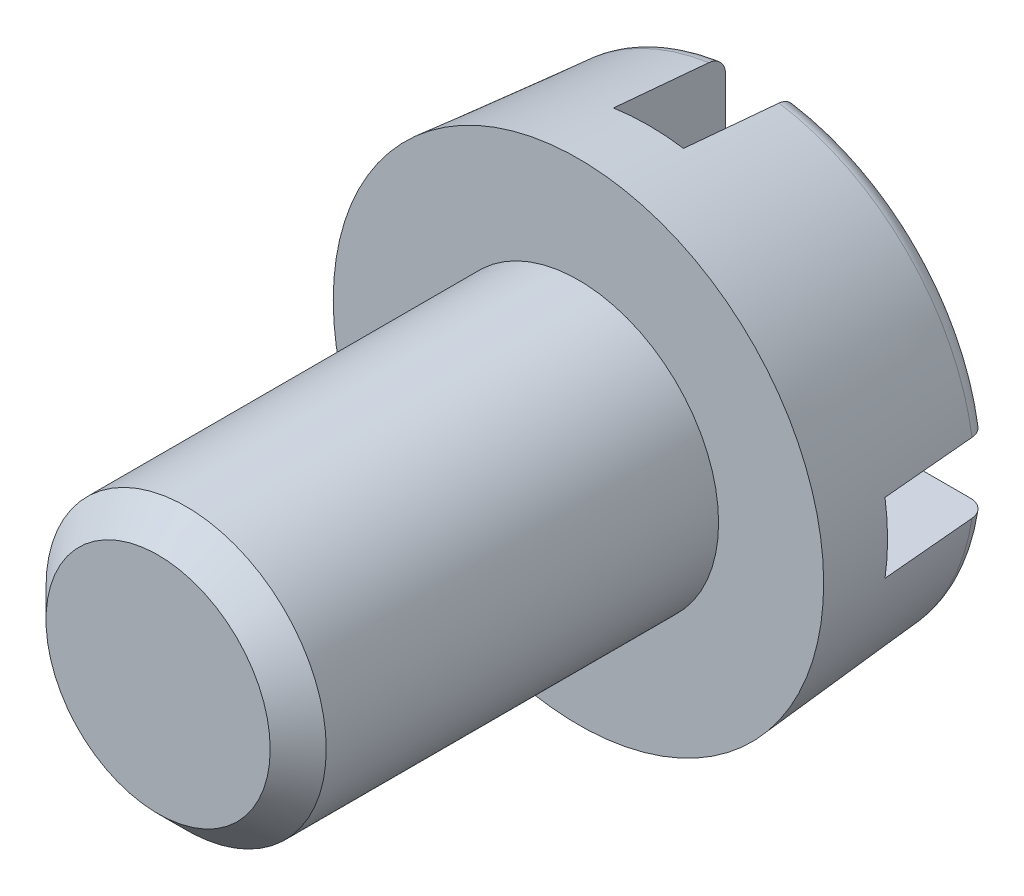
from build123d import *

# Parameters (mm, degrees)
ESQUISSE2_W                  = 7
ESQUISSE2_H                  = 1
ENLEV_MAT_EXTRU_1_DEPTH      = 1.6
ESQUISSE3_W                  = 2
ESQUISSE3_H                  = 6
CHANFREIN1_SIZE              = 0.4
R_P_TITION_CIRCULAIRE1_COUNT = 2
R_P_TITION_CIRCULAIRE1_ANGLE = 90


with BuildPart() as part:
    # Esquisse1 → Base-R_volution (revolve)
    with BuildSketch(Plane(origin=(0, 0, 0), x_dir=(1, 0, 0), z_dir=(0, 1, 0)), mode=Mode.PRIVATE) as base_r_volution_sk:
        with BuildLine():
            Line((0, 0), (3.5, 0))
            Line((3.5, 0), (3.293293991, 2.362660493))
            ThreePointArc((3.293293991, 2.362660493), (3.209936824, 2.531692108), (3.03428337, 2.6))
            Line((3.03428337, 2.6), (0, 2.6))
            Line((0, 2.6), (0, 0))
        make_face()
    revolve(base_r_volution_sk.sketch.rotate(Axis((0, 0, 0), (0, 0, -1)), 180), axis=Axis((0, 0, 0), (0, 0, -1)))

    # Esquisse2 → Enlev. mat.-Extru.1 (cut)
    with BuildSketch(Plane.XY.offset(-2.6)):
        Rectangle(ESQUISSE2_W, ESQUISSE2_H)
    enlev_mat_extru_1 = extrude(amount=ENLEV_MAT_EXTRU_1_DEPTH, mode=Mode.SUBTRACT)

    # Esquisse3 → Boss.-R_vol.1 (revolve)
    with BuildSketch(Plane(origin=(0, 0, 0), x_dir=(1, 0, 0), z_dir=(0, 1, 0)), mode=Mode.PRIVATE) as boss_r_vol_1_sk:
        with Locations((1, -3)):
            Rectangle(ESQUISSE3_W, ESQUISSE3_H)
    revolve(boss_r_vol_1_sk.sketch.rotate(Axis((0, 0, 0), (0, 0, 1)), 351.574710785), axis=Axis((0, 0, 0), (0, 0, 1)))

    # Chanfrein1
    chanfrein1_edges = [part.edges().sort_by_distance(p)[0] for p in [
        (-1.978415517, 0.293039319, 6),
    ]]
    chamfer(chanfrein1_edges, length=CHANFREIN1_SIZE)

    # R_p_tition circulaire1: Enlev. mat.-Extru.1 ×2 about axis
    r_p_tition_circulaire1_axis = Axis((0, 0, 0), (0, 0, 1))
    for i in range(1, R_P_TITION_CIRCULAIRE1_COUNT):
        add(enlev_mat_extru_1.rotate(r_p_tition_circulaire1_axis, i * R_P_TITION_CIRCULAIRE1_ANGLE / (R_P_TITION_CIRCULAIRE1_COUNT - 1)), mode=Mode.SUBTRACT)


solid = part.part
